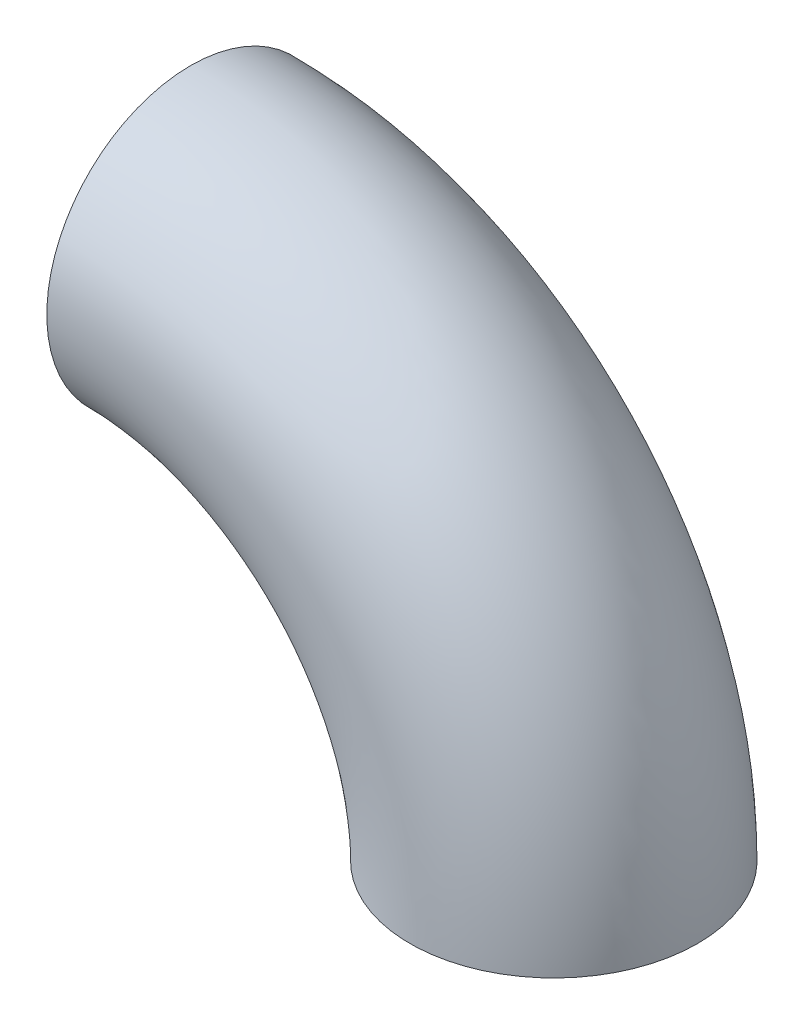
ISO-10303-21;
HEADER;
FILE_DESCRIPTION(('STEP AP214'),'2;1');
FILE_NAME('part.step','',(''),(''),'','','');
FILE_SCHEMA(('AUTOMOTIVE_DESIGN { 1 0 10303 214 1 1 1 1 }'));
ENDSEC;
DATA;
#1=APPLICATION_CONTEXT('core data for automotive mechanical design processes');
#2=APPLICATION_PROTOCOL_DEFINITION('international standard','automotive_design',2000,#1);
#3=PRODUCT_CONTEXT('',#1,'mechanical');
#4=PRODUCT('Part','Part','',(#3));
#5=PRODUCT_RELATED_PRODUCT_CATEGORY('part','',(#4));
#6=PRODUCT_DEFINITION_FORMATION('','',#4);
#7=PRODUCT_DEFINITION_CONTEXT('part definition',#1,'design');
#8=PRODUCT_DEFINITION('design','',#6,#7);
#9=PRODUCT_DEFINITION_SHAPE('','',#8);
#10=(LENGTH_UNIT() NAMED_UNIT(*) SI_UNIT(.MILLI.,.METRE.));
#11=(NAMED_UNIT(*) PLANE_ANGLE_UNIT() SI_UNIT($,.RADIAN.));
#12=(NAMED_UNIT(*) SI_UNIT($,.STERADIAN.) SOLID_ANGLE_UNIT());
#13=UNCERTAINTY_MEASURE_WITH_UNIT(LENGTH_MEASURE(1.E-05),#10,'distance_accuracy_value','');
#14=(GEOMETRIC_REPRESENTATION_CONTEXT(3) GLOBAL_UNCERTAINTY_ASSIGNED_CONTEXT((#13)) GLOBAL_UNIT_ASSIGNED_CONTEXT((#10,
#11,#12)) REPRESENTATION_CONTEXT('',''));
#15=CARTESIAN_POINT('',(0.,0.,0.));
#16=DIRECTION('',(0.,0.,1.));
#17=DIRECTION('',(1.,0.,0.));
#18=AXIS2_PLACEMENT_3D('',#15,#16,#17);
#19=CARTESIAN_POINT('',(-76.2,0.,0.));
#20=DIRECTION('',(0.,0.,-1.));
#21=DIRECTION('',(-1.,0.,0.));
#22=AXIS2_PLACEMENT_3D('',#19,#20,#21);
#23=TOROIDAL_SURFACE('',#22,76.2,26.2509);
#24=CARTESIAN_POINT('',(-76.2,76.2,0.));
#25=DIRECTION('',(-1.,0.,0.));
#26=DIRECTION('',(0.,0.,1.));
#27=AXIS2_PLACEMENT_3D('',#24,#25,#26);
#28=CIRCLE('',#27,26.2509);
#29=CARTESIAN_POINT('',(-76.2,102.4509,0.));
#30=VERTEX_POINT('',#29);
#31=EDGE_CURVE('E40',#30,#30,#28,.T.);
#32=CARTESIAN_POINT('',(0.,0.,0.));
#33=DIRECTION('',(0.,1.,0.));
#34=DIRECTION('',(0.,0.,1.));
#35=AXIS2_PLACEMENT_3D('',#32,#33,#34);
#36=CIRCLE('',#35,26.2509);
#37=CARTESIAN_POINT('',(26.2509,0.,0.));
#38=VERTEX_POINT('',#37);
#39=EDGE_CURVE('E48',#38,#38,#36,.T.);
#40=CARTESIAN_POINT('',(-76.2,0.,0.));
#41=DIRECTION('',(0.,0.,-1.));
#42=DIRECTION('',(-1.,0.,0.));
#43=AXIS2_PLACEMENT_3D('',#40,#41,#42);
#44=CIRCLE('',#43,102.4509);
#45=EDGE_CURVE('',#30,#38,#44,.T.);
#46=ORIENTED_EDGE('',*,*,#31,.T.);
#47=ORIENTED_EDGE('',*,*,#39,.F.);
#48=ORIENTED_EDGE('',*,*,#45,.T.);
#49=ORIENTED_EDGE('',*,*,#45,.F.);
#50=EDGE_LOOP('',(#46,#48,#47,#49));
#51=FACE_BOUND('',#50,.T.);
#52=ADVANCED_FACE('F33',(#51),#23,.F.);
#53=CARTESIAN_POINT('',(-76.2,0.,0.));
#54=DIRECTION('',(0.,0.,-1.));
#55=DIRECTION('',(-1.,0.,0.));
#56=AXIS2_PLACEMENT_3D('',#53,#54,#55);
#57=TOROIDAL_SURFACE('',#56,76.2,30.1625);
#58=CARTESIAN_POINT('',(-76.2,76.2,0.));
#59=DIRECTION('',(-1.,0.,0.));
#60=DIRECTION('',(0.,0.,1.));
#61=AXIS2_PLACEMENT_3D('',#58,#59,#60);
#62=CIRCLE('',#61,30.1625);
#63=CARTESIAN_POINT('',(-76.2,106.3625,0.));
#64=VERTEX_POINT('',#63);
#65=EDGE_CURVE('E10',#64,#64,#62,.T.);
#66=CARTESIAN_POINT('',(0.,0.,0.));
#67=DIRECTION('',(0.,1.,0.));
#68=DIRECTION('',(0.,0.,1.));
#69=AXIS2_PLACEMENT_3D('',#66,#67,#68);
#70=CIRCLE('',#69,30.1625);
#71=CARTESIAN_POINT('',(30.1625,0.,0.));
#72=VERTEX_POINT('',#71);
#73=EDGE_CURVE('E44',#72,#72,#70,.T.);
#74=CARTESIAN_POINT('',(-76.2,0.,0.));
#75=DIRECTION('',(0.,0.,-1.));
#76=DIRECTION('',(-1.,0.,0.));
#77=AXIS2_PLACEMENT_3D('',#74,#75,#76);
#78=CIRCLE('',#77,106.3625);
#79=EDGE_CURVE('',#64,#72,#78,.T.);
#80=ORIENTED_EDGE('',*,*,#65,.F.);
#81=ORIENTED_EDGE('',*,*,#73,.T.);
#82=ORIENTED_EDGE('',*,*,#79,.T.);
#83=ORIENTED_EDGE('',*,*,#79,.F.);
#84=EDGE_LOOP('',(#80,#82,#81,#83));
#85=FACE_BOUND('',#84,.T.);
#86=ADVANCED_FACE('F35',(#85),#57,.T.);
#87=CARTESIAN_POINT('',(-76.2,76.2,0.));
#88=DIRECTION('',(-1.,0.,0.));
#89=DIRECTION('',(0.,0.,1.));
#90=AXIS2_PLACEMENT_3D('',#87,#88,#89);
#91=PLANE('',#90);
#92=ORIENTED_EDGE('',*,*,#31,.F.);
#93=EDGE_LOOP('',(#92));
#94=FACE_BOUND('',#93,.T.);
#95=ORIENTED_EDGE('',*,*,#65,.T.);
#96=EDGE_LOOP('',(#95));
#97=FACE_BOUND('',#96,.T.);
#98=ADVANCED_FACE('F61',(#94,#97),#91,.T.);
#99=CARTESIAN_POINT('',(0.,0.,0.));
#100=DIRECTION('',(0.,1.,0.));
#101=DIRECTION('',(0.,0.,1.));
#102=AXIS2_PLACEMENT_3D('',#99,#100,#101);
#103=PLANE('',#102);
#104=ORIENTED_EDGE('',*,*,#39,.T.);
#105=EDGE_LOOP('',(#104));
#106=FACE_BOUND('',#105,.T.);
#107=ORIENTED_EDGE('',*,*,#73,.F.);
#108=EDGE_LOOP('',(#107));
#109=FACE_BOUND('',#108,.T.);
#110=ADVANCED_FACE('F54',(#106,#109),#103,.F.);
#111=CLOSED_SHELL('',(#52,#86,#98,#110));
#112=MANIFOLD_SOLID_BREP('B2',#111);
#113=ADVANCED_BREP_SHAPE_REPRESENTATION('',(#18,#112),#14);
#114=SHAPE_DEFINITION_REPRESENTATION(#9,#113);
ENDSEC;
END-ISO-10303-21;
